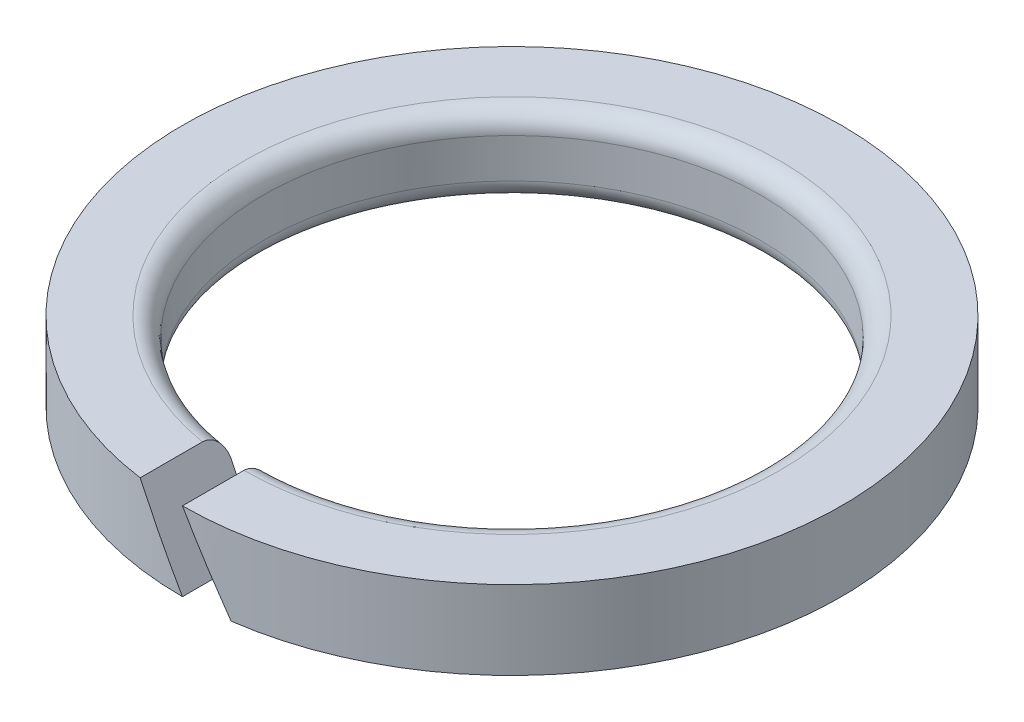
ISO-10303-21;
HEADER;
FILE_DESCRIPTION(('STEP AP214'),'2;1');
FILE_NAME('part.step','',(''),(''),'','','');
FILE_SCHEMA(('AUTOMOTIVE_DESIGN { 1 0 10303 214 1 1 1 1 }'));
ENDSEC;
DATA;
#1=APPLICATION_CONTEXT('core data for automotive mechanical design processes');
#2=APPLICATION_PROTOCOL_DEFINITION('international standard','automotive_design',2000,#1);
#3=PRODUCT_CONTEXT('',#1,'mechanical');
#4=PRODUCT('Part','Part','',(#3));
#5=PRODUCT_RELATED_PRODUCT_CATEGORY('part','',(#4));
#6=PRODUCT_DEFINITION_FORMATION('','',#4);
#7=PRODUCT_DEFINITION_CONTEXT('part definition',#1,'design');
#8=PRODUCT_DEFINITION('design','',#6,#7);
#9=PRODUCT_DEFINITION_SHAPE('','',#8);
#10=(LENGTH_UNIT() NAMED_UNIT(*) SI_UNIT(.MILLI.,.METRE.));
#11=(NAMED_UNIT(*) PLANE_ANGLE_UNIT() SI_UNIT($,.RADIAN.));
#12=(NAMED_UNIT(*) SI_UNIT($,.STERADIAN.) SOLID_ANGLE_UNIT());
#13=UNCERTAINTY_MEASURE_WITH_UNIT(LENGTH_MEASURE(1.E-05),#10,'distance_accuracy_value','');
#14=(GEOMETRIC_REPRESENTATION_CONTEXT(3) GLOBAL_UNCERTAINTY_ASSIGNED_CONTEXT((#13)) GLOBAL_UNIT_ASSIGNED_CONTEXT((#10,
#11,#12)) REPRESENTATION_CONTEXT('',''));
#15=CARTESIAN_POINT('',(0.,0.,0.));
#16=DIRECTION('',(0.,0.,1.));
#17=DIRECTION('',(1.,0.,0.));
#18=AXIS2_PLACEMENT_3D('',#15,#16,#17);
#19=CARTESIAN_POINT('',(0.,8.,0.));
#20=DIRECTION('',(0.,1.,0.));
#21=DIRECTION('',(0.,0.,1.));
#22=AXIS2_PLACEMENT_3D('',#19,#20,#21);
#23=PLANE('',#22);
#24=DIRECTION('',(0.,0.,-1.));
#25=VECTOR('',#24,1.);
#26=CARTESIAN_POINT('',(-4.61880215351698,8.,33.5));
#27=LINE('',#26,#25);
#28=CARTESIAN_POINT('',(-4.61880215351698,8.,33.1800642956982));
#29=VERTEX_POINT('',#28);
#30=CARTESIAN_POINT('',(-4.61880215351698,8.,26.855710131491));
#31=VERTEX_POINT('',#30);
#32=EDGE_CURVE('E106',#29,#31,#27,.T.);
#33=ORIENTED_EDGE('',*,*,#32,.T.);
#34=CARTESIAN_POINT('',(0.,8.,0.));
#35=DIRECTION('',(0.,1.,0.));
#36=DIRECTION('',(0.,0.,1.));
#37=AXIS2_PLACEMENT_3D('',#34,#35,#36);
#38=CIRCLE('',#37,27.25);
#39=CARTESIAN_POINT('',(0.,8.,27.25));
#40=VERTEX_POINT('',#39);
#41=EDGE_CURVE('E11',#31,#40,#38,.F.);
#42=ORIENTED_EDGE('',*,*,#41,.T.);
#43=DIRECTION('',(0.,0.,-1.));
#44=VECTOR('',#43,1.);
#45=CARTESIAN_POINT('',(0.,8.,33.5));
#46=LINE('',#45,#44);
#47=CARTESIAN_POINT('',(0.,8.,33.5));
#48=VERTEX_POINT('',#47);
#49=EDGE_CURVE('E94',#48,#40,#46,.T.);
#50=ORIENTED_EDGE('',*,*,#49,.F.);
#51=CARTESIAN_POINT('',(0.,8.,0.));
#52=DIRECTION('',(0.,1.,0.));
#53=DIRECTION('',(0.,0.,1.));
#54=AXIS2_PLACEMENT_3D('',#51,#52,#53);
#55=CIRCLE('',#54,33.5);
#56=EDGE_CURVE('E105',#48,#29,#55,.T.);
#57=ORIENTED_EDGE('',*,*,#56,.T.);
#58=EDGE_LOOP('',(#33,#42,#50,#57));
#59=FACE_BOUND('',#58,.T.);
#60=ADVANCED_FACE('F39',(#59),#23,.T.);
#61=CARTESIAN_POINT('',(0.,0.,0.));
#62=DIRECTION('',(0.,1.,0.));
#63=DIRECTION('',(0.,0.,1.));
#64=AXIS2_PLACEMENT_3D('',#61,#62,#63);
#65=PLANE('',#64);
#66=DIRECTION('',(0.,0.,-1.));
#67=VECTOR('',#66,1.);
#68=CARTESIAN_POINT('',(4.61880215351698,0.,33.5));
#69=LINE('',#68,#67);
#70=CARTESIAN_POINT('',(4.61880215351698,0.,33.1800642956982));
#71=VERTEX_POINT('',#70);
#72=CARTESIAN_POINT('',(4.61880215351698,0.,26.855710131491));
#73=VERTEX_POINT('',#72);
#74=EDGE_CURVE('E96',#71,#73,#69,.T.);
#75=ORIENTED_EDGE('',*,*,#74,.T.);
#76=CARTESIAN_POINT('',(0.,0.,0.));
#77=DIRECTION('',(0.,1.,0.));
#78=DIRECTION('',(0.,0.,1.));
#79=AXIS2_PLACEMENT_3D('',#76,#77,#78);
#80=CIRCLE('',#79,27.25);
#81=CARTESIAN_POINT('',(0.,0.,27.25));
#82=VERTEX_POINT('',#81);
#83=EDGE_CURVE('E119',#73,#82,#80,.T.);
#84=ORIENTED_EDGE('',*,*,#83,.T.);
#85=DIRECTION('',(0.,0.,-1.));
#86=VECTOR('',#85,1.);
#87=CARTESIAN_POINT('',(0.,0.,33.5));
#88=LINE('',#87,#86);
#89=CARTESIAN_POINT('',(0.,0.,33.5));
#90=VERTEX_POINT('',#89);
#91=EDGE_CURVE('E220',#90,#82,#88,.T.);
#92=ORIENTED_EDGE('',*,*,#91,.F.);
#93=CARTESIAN_POINT('',(0.,0.,0.));
#94=DIRECTION('',(0.,1.,0.));
#95=DIRECTION('',(0.,0.,1.));
#96=AXIS2_PLACEMENT_3D('',#93,#94,#95);
#97=CIRCLE('',#96,33.5);
#98=EDGE_CURVE('E101',#71,#90,#97,.T.);
#99=ORIENTED_EDGE('',*,*,#98,.F.);
#100=EDGE_LOOP('',(#75,#84,#92,#99));
#101=FACE_BOUND('',#100,.T.);
#102=ADVANCED_FACE('F165',(#101),#65,.F.);
#103=CARTESIAN_POINT('',(0.,8.,0.));
#104=DIRECTION('',(0.,-1.,0.));
#105=DIRECTION('',(0.,0.,-1.));
#106=AXIS2_PLACEMENT_3D('',#103,#104,#105);
#107=CYLINDRICAL_SURFACE('',#106,33.5);
#108=CARTESIAN_POINT('',(0.,8.,0.));
#109=DIRECTION('',(-0.86602540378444,-0.499999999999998,0.));
#110=DIRECTION('',(0.499999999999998,-0.86602540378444,0.));
#111=AXIS2_PLACEMENT_3D('',#108,#109,#110);
#112=ELLIPSE('',#111,67.0000000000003,33.5);
#113=EDGE_CURVE('E92',#71,#48,#112,.T.);
#114=ORIENTED_EDGE('',*,*,#113,.F.);
#115=ORIENTED_EDGE('',*,*,#98,.T.);
#116=CARTESIAN_POINT('',(0.,0.,0.));
#117=DIRECTION('',(0.86602540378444,0.499999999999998,0.));
#118=DIRECTION('',(0.499999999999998,-0.86602540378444,0.));
#119=AXIS2_PLACEMENT_3D('',#116,#117,#118);
#120=ELLIPSE('',#119,67.0000000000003,33.5);
#121=EDGE_CURVE('E102',#29,#90,#120,.T.);
#122=ORIENTED_EDGE('',*,*,#121,.F.);
#123=ORIENTED_EDGE('',*,*,#56,.F.);
#124=EDGE_LOOP('',(#114,#115,#122,#123));
#125=FACE_BOUND('',#124,.T.);
#126=ADVANCED_FACE('F109',(#125),#107,.T.);
#127=CARTESIAN_POINT('',(0.,8.,0.));
#128=DIRECTION('',(0.,-1.,0.));
#129=DIRECTION('',(0.,0.,-1.));
#130=AXIS2_PLACEMENT_3D('',#127,#128,#129);
#131=CYLINDRICAL_SURFACE('',#130,25.25);
#132=CARTESIAN_POINT('',(0.,0.,0.));
#133=DIRECTION('',(0.86602540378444,0.499999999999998,0.));
#134=DIRECTION('',(0.499999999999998,-0.86602540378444,0.));
#135=AXIS2_PLACEMENT_3D('',#132,#133,#134);
#136=ELLIPSE('',#135,50.5000000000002,25.25);
#137=CARTESIAN_POINT('',(-3.46410161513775,6.00000000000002,25.0112474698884));
#138=VERTEX_POINT('',#137);
#139=CARTESIAN_POINT('',(-1.15470053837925,2.00000000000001,25.2235835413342));
#140=VERTEX_POINT('',#139);
#141=EDGE_CURVE('E110',#138,#140,#136,.T.);
#142=ORIENTED_EDGE('',*,*,#141,.T.);
#143=CARTESIAN_POINT('',(0.,2.,0.));
#144=DIRECTION('',(0.,1.,0.));
#145=DIRECTION('',(0.,0.,1.));
#146=AXIS2_PLACEMENT_3D('',#143,#144,#145);
#147=CIRCLE('',#146,25.25);
#148=CARTESIAN_POINT('',(3.46410161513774,2.,25.0112474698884));
#149=VERTEX_POINT('',#148);
#150=EDGE_CURVE('E215',#140,#149,#147,.F.);
#151=ORIENTED_EDGE('',*,*,#150,.T.);
#152=CARTESIAN_POINT('',(0.,8.,0.));
#153=DIRECTION('',(-0.86602540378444,-0.499999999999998,0.));
#154=DIRECTION('',(0.499999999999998,-0.86602540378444,0.));
#155=AXIS2_PLACEMENT_3D('',#152,#153,#154);
#156=ELLIPSE('',#155,50.5000000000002,25.25);
#157=CARTESIAN_POINT('',(1.15470053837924,6.,25.2235835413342));
#158=VERTEX_POINT('',#157);
#159=EDGE_CURVE('E113',#149,#158,#156,.T.);
#160=ORIENTED_EDGE('',*,*,#159,.T.);
#161=CARTESIAN_POINT('',(0.,6.,0.));
#162=DIRECTION('',(0.,1.,0.));
#163=DIRECTION('',(0.,0.,1.));
#164=AXIS2_PLACEMENT_3D('',#161,#162,#163);
#165=CIRCLE('',#164,25.25);
#166=EDGE_CURVE('E214',#158,#138,#165,.T.);
#167=ORIENTED_EDGE('',*,*,#166,.T.);
#168=EDGE_LOOP('',(#142,#151,#160,#167));
#169=FACE_BOUND('',#168,.T.);
#170=ADVANCED_FACE('F139',(#169),#131,.F.);
#171=CARTESIAN_POINT('',(0.,0.,33.5));
#172=DIRECTION('',(0.86602540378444,0.499999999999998,0.));
#173=DIRECTION('',(-0.499999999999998,0.86602540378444,0.));
#174=AXIS2_PLACEMENT_3D('',#171,#172,#173);
#175=PLANE('',#174);
#176=ORIENTED_EDGE('',*,*,#91,.T.);
#177=CARTESIAN_POINT('',(0.,0.,27.25));
#178=CARTESIAN_POINT('',(5.10975107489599E-06,-8.85034847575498E-06,27.1990278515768));
#179=CARTESIAN_POINT('',(-0.0011248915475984,0.00194836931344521,27.1480607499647));
#180=CARTESIAN_POINT('',(-0.00561609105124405,0.00972735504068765,27.0465383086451));
#181=CARTESIAN_POINT('',(-0.00897652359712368,0.0155477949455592,26.9959828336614));
#182=CARTESIAN_POINT('',(-0.0178697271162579,0.0309512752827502,26.8958736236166));
#183=CARTESIAN_POINT('',(-0.0233927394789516,0.0405174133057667,26.8463164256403));
#184=CARTESIAN_POINT('',(-0.0365335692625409,0.0632779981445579,26.7483380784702));
#185=CARTESIAN_POINT('',(-0.0441514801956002,0.076472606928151,26.6999169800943));
#186=CARTESIAN_POINT('',(-0.0699989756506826,0.12124178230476,26.5569489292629));
#187=CARTESIAN_POINT('',(-0.0912393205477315,0.158031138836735,26.4645103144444));
#188=CARTESIAN_POINT('',(-0.140780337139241,0.243838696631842,26.2875643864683));
#189=CARTESIAN_POINT('',(-0.169087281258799,0.29286776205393,26.2030642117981));
#190=CARTESIAN_POINT('',(-0.233398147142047,0.404257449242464,26.0390508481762));
#191=CARTESIAN_POINT('',(-0.269740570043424,0.467204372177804,25.9600700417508));
#192=CARTESIAN_POINT('',(-0.347790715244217,0.602391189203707,25.8136143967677));
#193=CARTESIAN_POINT('',(-0.389499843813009,0.674633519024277,25.746142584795));
#194=CARTESIAN_POINT('',(-0.483302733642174,0.837104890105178,25.614551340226));
#195=CARTESIAN_POINT('',(-0.536031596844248,0.928433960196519,25.5522445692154));
#196=CARTESIAN_POINT('',(-0.645480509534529,1.11800503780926,25.4435688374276));
#197=CARTESIAN_POINT('',(-0.702205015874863,1.21625476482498,25.3972180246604));
#198=CARTESIAN_POINT('',(-0.823899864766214,1.42703642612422,25.3169212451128));
#199=CARTESIAN_POINT('',(-0.889138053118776,1.5400322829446,25.2846011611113));
#200=CARTESIAN_POINT('',(-1.02112812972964,1.76864580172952,25.239492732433));
#201=CARTESIAN_POINT('',(-1.08787610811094,1.88425669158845,25.2266587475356));
#202=CARTESIAN_POINT('',(-1.15470053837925,2.,25.2235835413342));
#203=B_SPLINE_CURVE_WITH_KNOTS('',3,(#177,#178,#179,#180,#181,#182,#183,#184,#185,#186,#187,
#188,#189,#190,#191,#192,#193,#194,#195,#196,#197,#198,#199,#200,#201,#202),.UNSPECIFIED.,.F.,
.F.,(4,2,2,2,2,2,2,2,2,2,2,2,4),(0.,0.152857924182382,0.305663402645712,0.45778715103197,
0.609917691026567,0.913616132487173,1.21758510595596,1.53832521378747,1.85914953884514,
2.22518957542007,2.59164457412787,2.99341414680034,3.39424123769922),.UNSPECIFIED.);
#204=EDGE_CURVE('E129',#82,#140,#203,.T.);
#205=ORIENTED_EDGE('',*,*,#204,.T.);
#206=ORIENTED_EDGE('',*,*,#141,.F.);
#207=CARTESIAN_POINT('',(-3.46410161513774,6.,25.0112474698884));
#208=CARTESIAN_POINT('',(-3.53490844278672,6.12264102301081,25.0014393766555));
#209=CARTESIAN_POINT('',(-3.60623476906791,6.24618184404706,25.0026556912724));
#210=CARTESIAN_POINT('',(-3.74850254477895,6.49259685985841,25.0284645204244));
#211=CARTESIAN_POINT('',(-3.81943347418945,6.61545283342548,25.0532846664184));
#212=CARTESIAN_POINT('',(-3.95833914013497,6.85604450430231,25.1280387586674));
#213=CARTESIAN_POINT('',(-4.02629895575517,6.97375435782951,25.1780864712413));
#214=CARTESIAN_POINT('',(-4.15571825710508,7.19791516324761,25.3040062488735));
#215=CARTESIAN_POINT('',(-4.21720661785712,7.30441612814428,25.3797566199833));
#216=CARTESIAN_POINT('',(-4.31413455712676,7.47230024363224,25.5308987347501));
#217=CARTESIAN_POINT('',(-4.35198422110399,7.53785778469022,25.6001484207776));
#218=CARTESIAN_POINT('',(-4.42139352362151,7.65807822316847,25.7503553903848));
#219=CARTESIAN_POINT('',(-4.45295478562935,7.71274393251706,25.831309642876));
#220=CARTESIAN_POINT('',(-4.5086093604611,7.80914048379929,26.0033233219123));
#221=CARTESIAN_POINT('',(-4.532676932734,7.85082674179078,26.0944161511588));
#222=CARTESIAN_POINT('',(-4.5722383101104,7.91934905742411,26.2837898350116));
#223=CARTESIAN_POINT('',(-4.58773499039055,7.94619009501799,26.3820682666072));
#224=CARTESIAN_POINT('',(-4.60543712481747,7.97685109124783,26.5435823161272));
#225=CARTESIAN_POINT('',(-4.61046595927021,7.98556128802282,26.6056413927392));
#226=CARTESIAN_POINT('',(-4.61714861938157,7.99713599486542,26.7303652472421));
#227=CARTESIAN_POINT('',(-4.61880882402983,8.00001155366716,26.7930286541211));
#228=CARTESIAN_POINT('',(-4.61880215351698,8.,26.855710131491));
#229=B_SPLINE_CURVE_WITH_KNOTS('',3,(#207,#208,#209,#210,#211,#212,#213,#214,#215,#216,#217,
#218,#219,#220,#221,#222,#223,#224,#225,#226,#227,#228),.UNSPECIFIED.,.F.,.F.,(4,2,2,2,2,2,2,2,
2,2,4),(0.,0.425865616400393,0.855880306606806,1.28785177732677,1.71780589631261,
2.02430834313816,2.3307315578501,2.63819600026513,2.94555723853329,3.13382712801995,
3.32174016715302),.UNSPECIFIED.);
#230=EDGE_CURVE('E122',#138,#31,#229,.T.);
#231=ORIENTED_EDGE('',*,*,#230,.T.);
#232=ORIENTED_EDGE('',*,*,#32,.F.);
#233=ORIENTED_EDGE('',*,*,#121,.T.);
#234=EDGE_LOOP('',(#176,#205,#206,#231,#232,#233));
#235=FACE_BOUND('',#234,.T.);
#236=ADVANCED_FACE('F135',(#235),#175,.T.);
#237=CARTESIAN_POINT('',(0.,8.,33.5));
#238=DIRECTION('',(-0.86602540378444,-0.499999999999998,0.));
#239=DIRECTION('',(0.499999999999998,-0.86602540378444,0.));
#240=AXIS2_PLACEMENT_3D('',#237,#238,#239);
#241=PLANE('',#240);
#242=ORIENTED_EDGE('',*,*,#159,.F.);
#243=CARTESIAN_POINT('',(3.46410161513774,2.,25.0112474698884));
#244=CARTESIAN_POINT('',(3.53490844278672,1.87735897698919,25.0014393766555));
#245=CARTESIAN_POINT('',(3.60623476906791,1.75381815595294,25.0026556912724));
#246=CARTESIAN_POINT('',(3.74850254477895,1.50740314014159,25.0284645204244));
#247=CARTESIAN_POINT('',(3.81943347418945,1.38454716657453,25.0532846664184));
#248=CARTESIAN_POINT('',(3.95833914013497,1.14395549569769,25.1280387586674));
#249=CARTESIAN_POINT('',(4.02629895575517,1.02624564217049,25.1780864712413));
#250=CARTESIAN_POINT('',(4.15571825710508,0.802084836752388,25.3040062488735));
#251=CARTESIAN_POINT('',(4.21720661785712,0.695583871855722,25.3797566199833));
#252=CARTESIAN_POINT('',(4.31413455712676,0.527699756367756,25.5308987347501));
#253=CARTESIAN_POINT('',(4.35198422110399,0.462142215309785,25.6001484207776));
#254=CARTESIAN_POINT('',(4.4213935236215,0.34192177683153,25.7503553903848));
#255=CARTESIAN_POINT('',(4.45295478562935,0.287256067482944,25.831309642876));
#256=CARTESIAN_POINT('',(4.5086093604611,0.190859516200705,26.0033233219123));
#257=CARTESIAN_POINT('',(4.532676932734,0.14917325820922,26.0944161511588));
#258=CARTESIAN_POINT('',(4.5722383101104,0.0806509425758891,26.2837898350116));
#259=CARTESIAN_POINT('',(4.58773499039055,0.0538099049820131,26.3820682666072));
#260=CARTESIAN_POINT('',(4.60543712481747,0.0231489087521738,26.5435823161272));
#261=CARTESIAN_POINT('',(4.61046595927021,0.0144387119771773,26.6056413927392));
#262=CARTESIAN_POINT('',(4.61714861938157,0.00286400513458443,26.7303652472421));
#263=CARTESIAN_POINT('',(4.61880882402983,-1.15536671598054E-05,26.7930286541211));
#264=CARTESIAN_POINT('',(4.61880215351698,0.,26.855710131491));
#265=B_SPLINE_CURVE_WITH_KNOTS('',3,(#243,#244,#245,#246,#247,#248,#249,#250,#251,#252,#253,
#254,#255,#256,#257,#258,#259,#260,#261,#262,#263,#264),.UNSPECIFIED.,.F.,.F.,(4,2,2,2,2,2,2,2,
2,2,4),(0.,0.425865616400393,0.855880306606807,1.28785177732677,1.71780589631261,
2.02430834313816,2.3307315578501,2.63819600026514,2.9455572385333,3.13382712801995,
3.32174016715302),.UNSPECIFIED.);
#266=EDGE_CURVE('E48',#149,#73,#265,.T.);
#267=ORIENTED_EDGE('',*,*,#266,.T.);
#268=ORIENTED_EDGE('',*,*,#74,.F.);
#269=ORIENTED_EDGE('',*,*,#113,.T.);
#270=ORIENTED_EDGE('',*,*,#49,.T.);
#271=CARTESIAN_POINT('',(0.,8.,27.25));
#272=CARTESIAN_POINT('',(-5.10975107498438E-06,8.00000885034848,27.1990278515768));
#273=CARTESIAN_POINT('',(0.00112489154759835,7.99805163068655,27.1480607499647));
#274=CARTESIAN_POINT('',(0.00561609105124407,7.99027264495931,27.0465383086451));
#275=CARTESIAN_POINT('',(0.00897652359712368,7.98445220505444,26.9959828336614));
#276=CARTESIAN_POINT('',(0.0178697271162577,7.96904872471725,26.8958736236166));
#277=CARTESIAN_POINT('',(0.0233927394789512,7.95948258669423,26.8463164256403));
#278=CARTESIAN_POINT('',(0.0365335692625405,7.93672200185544,26.7483380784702));
#279=CARTESIAN_POINT('',(0.0441514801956,7.92352739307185,26.6999169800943));
#280=CARTESIAN_POINT('',(0.0699989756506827,7.87875821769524,26.5569489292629));
#281=CARTESIAN_POINT('',(0.0912393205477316,7.84196886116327,26.4645103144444));
#282=CARTESIAN_POINT('',(0.14078033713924,7.75616130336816,26.2875643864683));
#283=CARTESIAN_POINT('',(0.169087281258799,7.70713223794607,26.2030642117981));
#284=CARTESIAN_POINT('',(0.233398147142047,7.59574255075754,26.0390508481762));
#285=CARTESIAN_POINT('',(0.269740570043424,7.5327956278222,25.9600700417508));
#286=CARTESIAN_POINT('',(0.347790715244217,7.39760881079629,25.8136143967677));
#287=CARTESIAN_POINT('',(0.389499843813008,7.32536648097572,25.746142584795));
#288=CARTESIAN_POINT('',(0.483302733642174,7.16289510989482,25.614551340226));
#289=CARTESIAN_POINT('',(0.536031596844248,7.07156603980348,25.5522445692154));
#290=CARTESIAN_POINT('',(0.645480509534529,6.88199496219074,25.4435688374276));
#291=CARTESIAN_POINT('',(0.702205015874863,6.78374523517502,25.3972180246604));
#292=CARTESIAN_POINT('',(0.823899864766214,6.57296357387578,25.3169212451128));
#293=CARTESIAN_POINT('',(0.889138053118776,6.4599677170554,25.2846011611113));
#294=CARTESIAN_POINT('',(1.02112812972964,6.23135419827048,25.239492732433));
#295=CARTESIAN_POINT('',(1.08787610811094,6.11574330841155,25.2266587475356));
#296=CARTESIAN_POINT('',(1.15470053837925,6.,25.2235835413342));
#297=B_SPLINE_CURVE_WITH_KNOTS('',3,(#271,#272,#273,#274,#275,#276,#277,#278,#279,#280,#281,
#282,#283,#284,#285,#286,#287,#288,#289,#290,#291,#292,#293,#294,#295,#296),.UNSPECIFIED.,.F.,
.F.,(4,2,2,2,2,2,2,2,2,2,2,2,4),(0.,0.152857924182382,0.305663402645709,0.457787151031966,
0.609917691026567,0.913616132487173,1.21758510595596,1.53832521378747,1.85914953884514,
2.22518957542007,2.59164457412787,2.99341414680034,3.39424123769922),.UNSPECIFIED.);
#298=EDGE_CURVE('E60',#40,#158,#297,.T.);
#299=ORIENTED_EDGE('',*,*,#298,.T.);
#300=EDGE_LOOP('',(#242,#267,#268,#269,#270,#299));
#301=FACE_BOUND('',#300,.T.);
#302=ADVANCED_FACE('F93',(#301),#241,.T.);
#303=CARTESIAN_POINT('',(0.,2.,0.));
#304=DIRECTION('',(0.,1.,0.));
#305=DIRECTION('',(0.,0.,1.));
#306=AXIS2_PLACEMENT_3D('',#303,#304,#305);
#307=TOROIDAL_SURFACE('',#306,27.25,2.);
#308=ORIENTED_EDGE('',*,*,#266,.F.);
#309=ORIENTED_EDGE('',*,*,#150,.F.);
#310=ORIENTED_EDGE('',*,*,#204,.F.);
#311=ORIENTED_EDGE('',*,*,#83,.F.);
#312=EDGE_LOOP('',(#308,#309,#310,#311));
#313=FACE_BOUND('',#312,.T.);
#314=ADVANCED_FACE('F145',(#313),#307,.T.);
#315=CARTESIAN_POINT('',(0.,6.,0.));
#316=DIRECTION('',(0.,1.,0.));
#317=DIRECTION('',(0.,0.,1.));
#318=AXIS2_PLACEMENT_3D('',#315,#316,#317);
#319=TOROIDAL_SURFACE('',#318,27.25,2.);
#320=ORIENTED_EDGE('',*,*,#298,.F.);
#321=ORIENTED_EDGE('',*,*,#41,.F.);
#322=ORIENTED_EDGE('',*,*,#230,.F.);
#323=ORIENTED_EDGE('',*,*,#166,.F.);
#324=EDGE_LOOP('',(#320,#321,#322,#323));
#325=FACE_BOUND('',#324,.T.);
#326=ADVANCED_FACE('F41',(#325),#319,.T.);
#327=CLOSED_SHELL('',(#60,#102,#126,#170,#236,#302,#314,#326));
#328=MANIFOLD_SOLID_BREP('B2',#327);
#329=ADVANCED_BREP_SHAPE_REPRESENTATION('',(#18,#328),#14);
#330=SHAPE_DEFINITION_REPRESENTATION(#9,#329);
ENDSEC;
END-ISO-10303-21;
